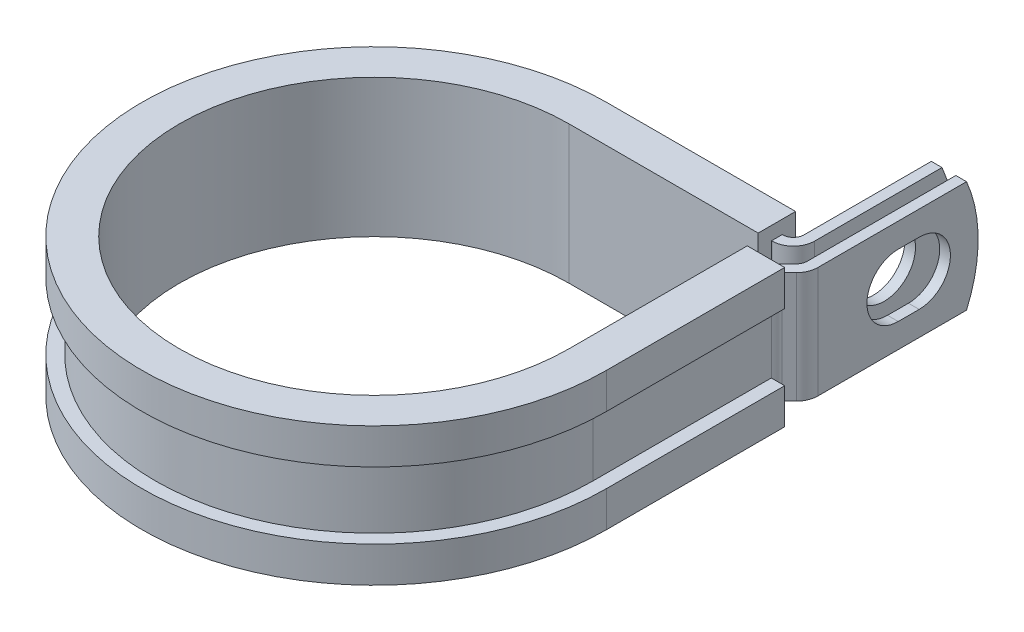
from build123d import *

# Parameters (mm, degrees)
EXTRUDE_THIN1_DEPTH = 6.35
SKETCH2_R           = 3.5687
CUT_EXTRUDE1_DEPTH  = 1.2192
CUT_EXTRUDE2_DEPTH  = 1.2192
CUT_EXTRUDE3_DEPTH  = 64.986313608


with BuildPart() as part:
    # Sketch1 → Extrude-Thin1 (new, symmetric)
    with BuildSketch(Plane(origin=(0, 0, 0), x_dir=(1, 0, 0), z_dir=(0, 1, 0))):
        with BuildLine():
            Line((25.6464698, 42.037), (25.6464698, 23.749))
            ThreePointArc((25.6464698, 23.749), (25.553663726, 23.282432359), (25.289374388, 22.886895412))
            Line((25.289374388, 22.886895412), (24.463190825, 22.060711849))
            ThreePointArc((24.463190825, 22.060711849), (23.934612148, 21.269637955), (23.749, 20.336502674))
            Line((23.749, 20.336502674), (23.749, 0))
            ThreePointArc((23.749, 0), (-16.793078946, -16.793078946), (0, 23.749))
            Line((0, 23.749), (21.6332698, 23.749))
            ThreePointArc((21.6332698, 23.749), (23.357478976, 24.463190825), (24.0716698, 26.1874))
            Line((24.0716698, 26.1874), (24.0716698, 42.037))
            Line((24.0716698, 42.037), (22.8524698, 42.037))
            Line((22.8524698, 42.037), (22.8524698, 26.1874))
            ThreePointArc((22.8524698, 26.1874), (22.495374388, 25.325295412), (21.6332698, 24.9682))
            Line((21.6332698, 24.9682), (0, 24.9682))
            ThreePointArc((0, 24.9682), (-17.655183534, -17.655183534), (24.9682, 0))
            Line((24.9682, 0), (24.9682, 20.336502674))
            ThreePointArc((24.9682, 20.336502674), (25.061006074, 20.803070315), (25.325295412, 21.198607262))
            Line((25.325295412, 21.198607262), (26.151478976, 22.024790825))
            ThreePointArc((26.151478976, 22.024790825), (26.680057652, 22.815864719), (26.8656698, 23.749))
            Line((26.8656698, 23.749), (26.8656698, 42.037))
            Line((26.8656698, 42.037), (25.6464698, 42.037))
        make_face()
    extrude(amount=EXTRUDE_THIN1_DEPTH, both=True)

    # Sketch2 → Cut-Extrude1 (cut)
    with BuildSketch(Plane.ZY.offset(-22.8524698)):
        with Locations((-34.1122, 0)):
            Circle(SKETCH2_R)
    extrude(amount=-CUT_EXTRUDE1_DEPTH, mode=Mode.SUBTRACT)

    # Sketch3 → Cut-Extrude2 (cut)
    with BuildSketch(Plane(origin=(26.8656698, 0, 0), x_dir=(0, 0, -1), z_dir=(1, 0, 0))):
        with BuildLine():
            Line((32.9184, 3.5687), (35.306, 3.5687))
            ThreePointArc((35.306, 3.5687), (38.8747, 0), (35.306, -3.5687))
            Line((35.306, -3.5687), (32.9184, -3.5687))
            ThreePointArc((32.9184, -3.5687), (29.3497, 0), (32.9184, 3.5687))
        make_face()
    extrude(amount=-CUT_EXTRUDE2_DEPTH, mode=Mode.SUBTRACT)

    # Sketch4 → Cut-Extrude3 (cut, through all)
    with BuildSketch(Plane.ZY.offset(-22.8524698)):
        with BuildLine():
            Line((-40.711677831, 6.35), (-42.037, 6.35))
            Line((-42.037, 6.35), (-42.037, 0))
            ThreePointArc((-42.037, 0), (-41.702137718, 3.243415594), (-40.711677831, 6.35))
        make_face()
        with BuildLine():
            ThreePointArc((-40.711677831, -6.35), (-41.702137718, -3.243415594), (-42.037, 0))
            Line((-42.037, 0), (-42.037, -6.35))
            Line((-42.037, -6.35), (-40.711677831, -6.35))
        make_face()
    extrude(amount=-CUT_EXTRUDE3_DEPTH, mode=Mode.SUBTRACT)

    # Sweep1: sweep along a path in Sketch6
    with BuildLine(Plane(origin=(0, 6.35, 0), x_dir=(1, 0, 0), z_dir=(0, 1, 0))) as sweep1_path:
        Line((22.225, 20.336502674), (22.225, 0))
        ThreePointArc((22.225, 0), (-15.715448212, -15.715448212), (0, 22.225))
        Line((0, 22.225), (21.5824698, 22.225))
    # Sketch5 → Sweep1 (sweep)
    with BuildSketch(Plane(origin=(0, 0, -20.336502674), x_dir=(-1, 0, 0), z_dir=(0, 0, -1))):
        Polygon((-24.9682, 6.35), (-23.749, 6.35), (-23.749, -6.35), (-24.9682, -6.35), (-24.9682, -3.81), (-26.4922, -3.81), (-26.4922, -7.874), (-22.225, -7.874), (-22.225, 7.874), (-26.4922, 7.874), (-26.4922, 3.81), (-24.9682, 3.81), align=None)
    sweep(path=sweep1_path.line)


solid = part.part
